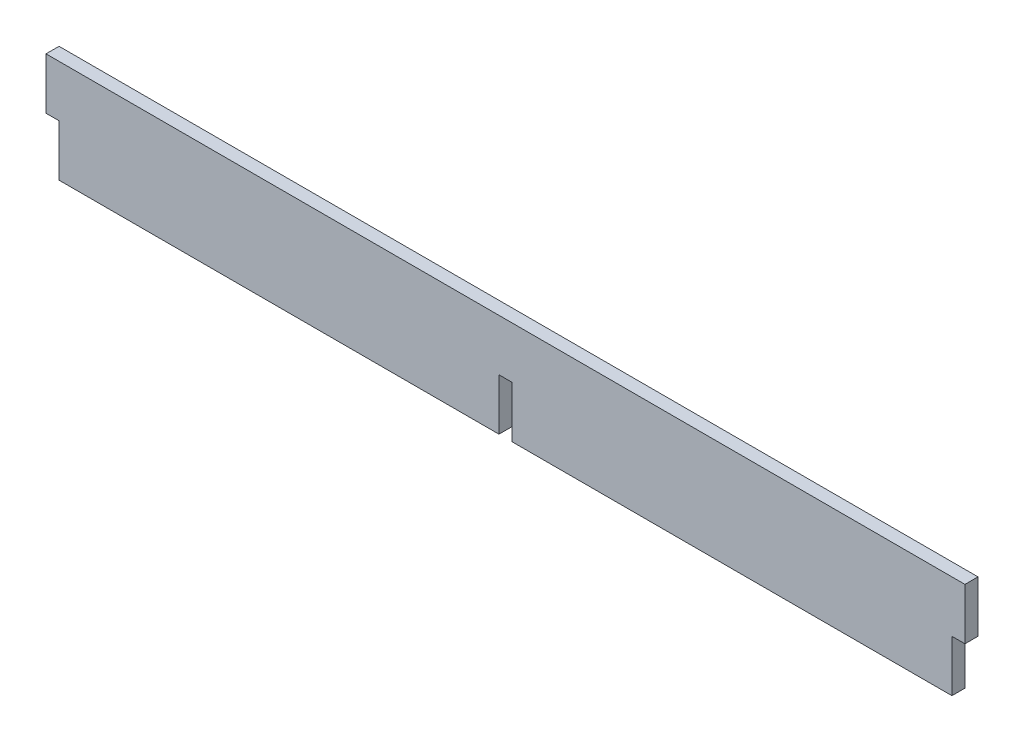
from build123d import *

# Parameters (mm, degrees)
BOSS_EXTRUDE1_DEPTH = 3.2


with BuildPart() as part:
    # Sketch1 → Boss-Extrude1 (new body)
    with BuildSketch(Plane.XY):
        Polygon((114.315, 1.865), (222.225, 1.865), (222.225, 14.49), (225.425, 14.49), (225.425, 27.115), (0, 27.115), (0, 14.49), (3.2, 14.49), (3.2, 1.865), (111.115, 1.865), (111.115, 14.49), (114.315, 14.49), align=None)
    extrude(amount=BOSS_EXTRUDE1_DEPTH)


solid = part.part
